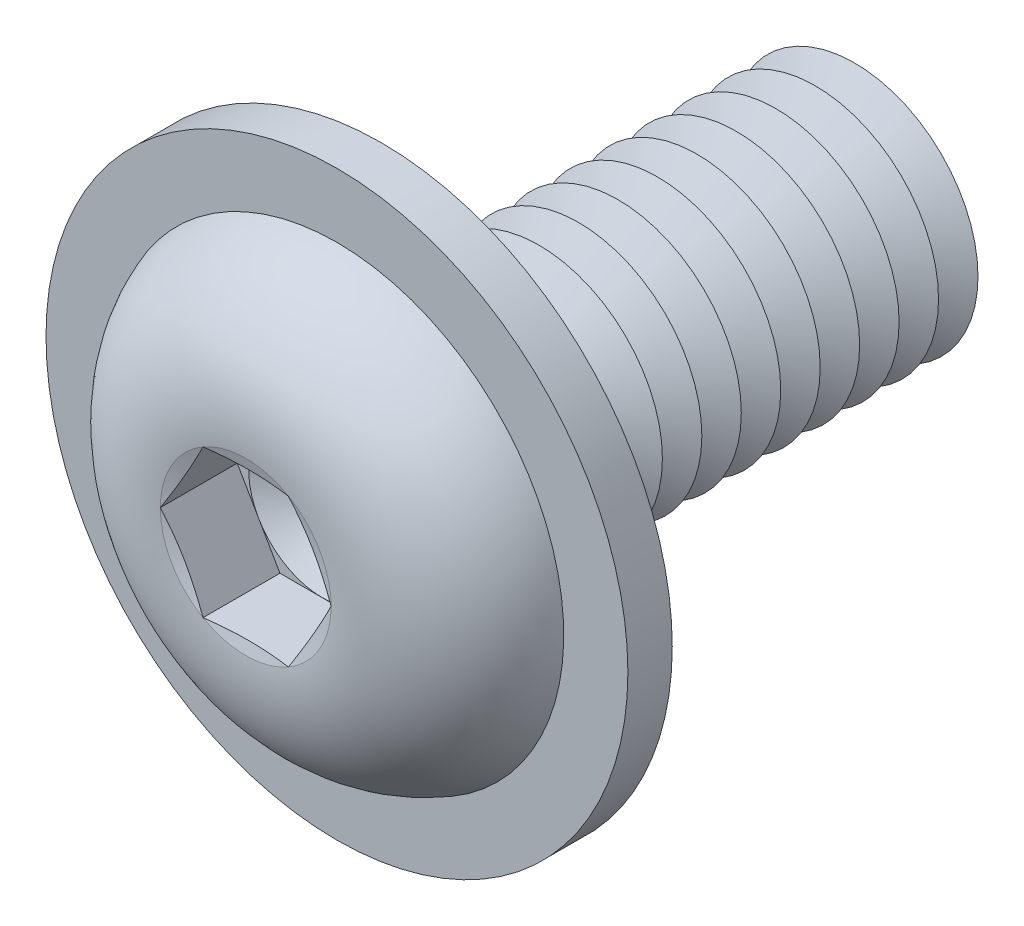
from build123d import *

# Parameters (mm, degrees)
FILLET1_R           = 0.4
LPATTERN1_COUNT     = 12
LPATTERN1_PITCH     = 0.8
CUT_EXTRUDE1_DEPTH  = 1.56
SKETCH5_R           = 5.9
SKETCH5_R_2         = 2.9
BOSS_EXTRUDE1_DEPTH = 0.9


with BuildPart() as part:
    # Sketch1 → Revolve1 (revolve)
    with BuildSketch(Plane(origin=(0, 0, 0), x_dir=(0, 0, -1), z_dir=(1, 0, 0)), mode=Mode.PRIVATE) as revolve1_sk:
        with BuildLine():
            Line((0, 2.5), (0, 4.75))
            ThreePointArc((0, 4.75), (-2.041477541, 3.848329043), (-2.75, 1.73205))
            Line((-2.75, 1.73205), (-2.517949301, 0.866025))
            Line((-2.517949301, 0.866025), (-2.75, 0.866025))
            Line((-2.75, 0.866025), (-2.75, 0))
            Line((-2.75, 0), (10, 0))
            Line((10, 0), (10, 2.5))
            Line((10, 2.5), (0, 2.5))
        make_face()
    revolve(revolve1_sk.sketch.rotate(Axis((0, 0, -10), (0, 0, 1)), 90), axis=Axis((0, 0, -10), (0, 0, 1)))

    # Fillet1
    fillet1_edges = [part.edges().sort_by_distance(p)[0] for p in [
        (2.5, 0, 0),
    ]]
    fillet(fillet1_edges, radius=FILLET1_R)

    # Sketch2 → Cut-Revolve1 (revolve, cut)
    with BuildSketch(Plane(origin=(0, 0, 0), x_dir=(0, 0, -1), z_dir=(1, 0, 0)), mode=Mode.PRIVATE) as cut_revolve1_sk:
        Polygon((9.6, 2.5), (10.4, 2.5), (10, 1.807179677), align=None)
    cut_revolve1 = revolve(cut_revolve1_sk.sketch.rotate(Axis((0, 0, -10), (0, 0, -1)), 270), axis=Axis((0, 0, -10), (0, 0, -1)), mode=Mode.SUBTRACT)

    # LPattern1: Cut-Revolve1 ×12
    with Locations(*[(0, 0, i * LPATTERN1_PITCH) for i in range(1, LPATTERN1_COUNT)]):
        add(cut_revolve1, mode=Mode.SUBTRACT)

    # Sketch3 → Cut-Extrude1 (cut)
    with BuildSketch(Plane.XY.offset(2.75)):
        Polygon((0.866025, 1.499999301), (-0.866025, 1.499999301), (-1.73205, 0), (-0.866025, -1.499999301), (0.866025, -1.499999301), (1.73205, 0), align=None)
    extrude(amount=-CUT_EXTRUDE1_DEPTH, mode=Mode.SUBTRACT)

    # Cut-Extrude2 cone 1 section (on through the dimple's axis) → Cut-Extrude2 (revolve, cut)
    with BuildSketch(Plane(origin=(0, 0, 1.19), x_dir=(0, -1, 0), z_dir=(1, 0, 0))):
        Polygon((0, 0), (1.499999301, 0), (0, 0.866025), align=None)
    revolve(axis=Axis((0, 0, 1.19), (0, 0, -1)), mode=Mode.SUBTRACT)

    # Sketch5 → Boss-Extrude1 (add)
    with BuildSketch(Plane(origin=(0, 0, 0), x_dir=(-1, 0, 0), z_dir=(0, 0, -1))):
        with Locations(Location((0, 0, 0), (0, 0, 90))):
            Circle(SKETCH5_R)
        Circle(SKETCH5_R_2, mode=Mode.SUBTRACT)
    extrude(amount=-BOSS_EXTRUDE1_DEPTH)


solid = part.part
